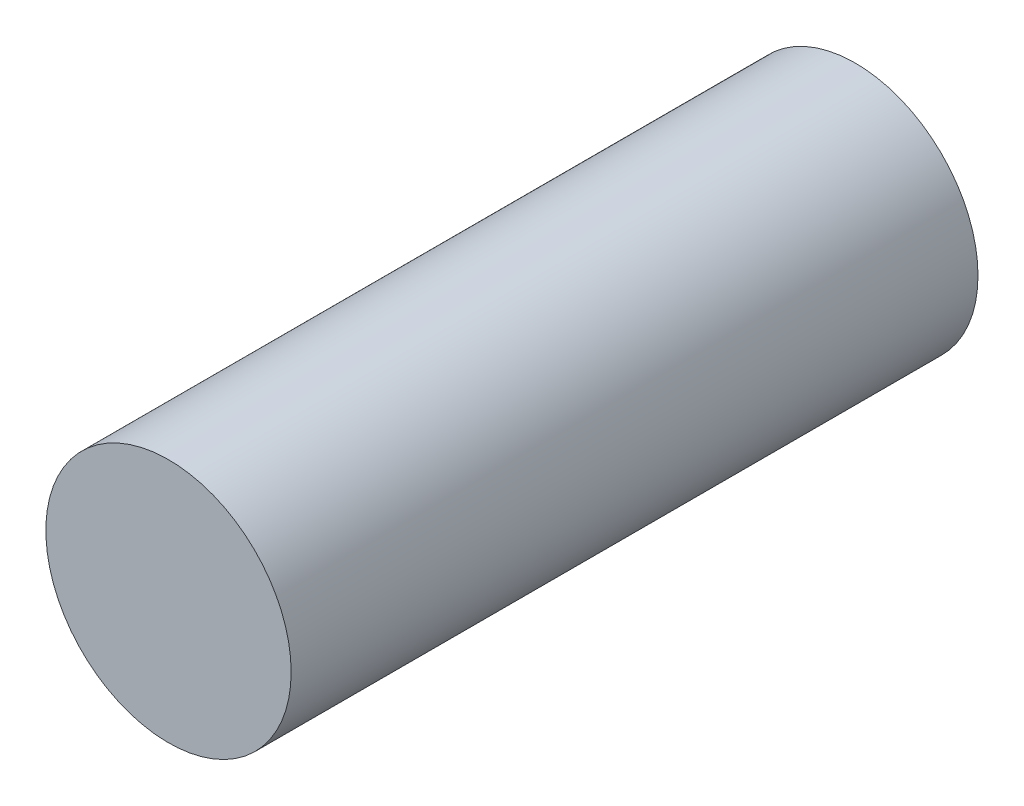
ISO-10303-21;
HEADER;
FILE_DESCRIPTION(('STEP AP214'),'2;1');
FILE_NAME('part.step','',(''),(''),'','','');
FILE_SCHEMA(('AUTOMOTIVE_DESIGN { 1 0 10303 214 1 1 1 1 }'));
ENDSEC;
DATA;
#1=APPLICATION_CONTEXT('core data for automotive mechanical design processes');
#2=APPLICATION_PROTOCOL_DEFINITION('international standard','automotive_design',2000,#1);
#3=PRODUCT_CONTEXT('',#1,'mechanical');
#4=PRODUCT('Part','Part','',(#3));
#5=PRODUCT_RELATED_PRODUCT_CATEGORY('part','',(#4));
#6=PRODUCT_DEFINITION_FORMATION('','',#4);
#7=PRODUCT_DEFINITION_CONTEXT('part definition',#1,'design');
#8=PRODUCT_DEFINITION('design','',#6,#7);
#9=PRODUCT_DEFINITION_SHAPE('','',#8);
#10=(LENGTH_UNIT() NAMED_UNIT(*) SI_UNIT(.MILLI.,.METRE.));
#11=(NAMED_UNIT(*) PLANE_ANGLE_UNIT() SI_UNIT($,.RADIAN.));
#12=(NAMED_UNIT(*) SI_UNIT($,.STERADIAN.) SOLID_ANGLE_UNIT());
#13=UNCERTAINTY_MEASURE_WITH_UNIT(LENGTH_MEASURE(1.E-05),#10,'distance_accuracy_value','');
#14=(GEOMETRIC_REPRESENTATION_CONTEXT(3) GLOBAL_UNCERTAINTY_ASSIGNED_CONTEXT((#13)) GLOBAL_UNIT_ASSIGNED_CONTEXT((#10,
#11,#12)) REPRESENTATION_CONTEXT('',''));
#15=CARTESIAN_POINT('',(0.,0.,0.));
#16=DIRECTION('',(0.,0.,1.));
#17=DIRECTION('',(1.,0.,0.));
#18=AXIS2_PLACEMENT_3D('',#15,#16,#17);
#19=CARTESIAN_POINT('',(-26.1172302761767,26.9098547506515,-12.5355339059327));
#20=DIRECTION('',(0.,0.,1.));
#21=DIRECTION('',(1.,0.,0.));
#22=AXIS2_PLACEMENT_3D('',#19,#20,#21);
#23=CYLINDRICAL_SURFACE('',#22,1.25);
#24=CARTESIAN_POINT('',(-26.1172302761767,26.9098547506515,-6.99999999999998));
#25=DIRECTION('',(0.,0.,1.));
#26=DIRECTION('',(1.,0.,0.));
#27=AXIS2_PLACEMENT_3D('',#24,#25,#26);
#28=CIRCLE('',#27,1.25);
#29=CARTESIAN_POINT('',(-24.8672302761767,26.9098547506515,-6.99999999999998));
#30=VERTEX_POINT('',#29);
#31=EDGE_CURVE('E11',#30,#30,#28,.F.);
#32=ORIENTED_EDGE('',*,*,#31,.F.);
#33=EDGE_LOOP('',(#32));
#34=FACE_BOUND('',#33,.T.);
#35=CARTESIAN_POINT('',(-26.1172302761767,26.9098547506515,0.));
#36=DIRECTION('',(0.,0.,1.));
#37=DIRECTION('',(1.,0.,0.));
#38=AXIS2_PLACEMENT_3D('',#35,#36,#37);
#39=CIRCLE('',#38,1.25);
#40=CARTESIAN_POINT('',(-24.8672302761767,26.9098547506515,0.));
#41=VERTEX_POINT('',#40);
#42=EDGE_CURVE('E381',#41,#41,#39,.T.);
#43=ORIENTED_EDGE('',*,*,#42,.F.);
#44=EDGE_LOOP('',(#43));
#45=FACE_BOUND('',#44,.T.);
#46=ADVANCED_FACE('F375',(#34,#45),#23,.T.);
#47=CARTESIAN_POINT('',(-26.1172302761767,26.9098547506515,0.));
#48=DIRECTION('',(0.,0.,1.));
#49=DIRECTION('',(1.,0.,0.));
#50=AXIS2_PLACEMENT_3D('',#47,#48,#49);
#51=PLANE('',#50);
#52=ORIENTED_EDGE('',*,*,#42,.T.);
#53=EDGE_LOOP('',(#52));
#54=FACE_BOUND('',#53,.T.);
#55=ADVANCED_FACE('F387',(#54),#51,.T.);
#56=CARTESIAN_POINT('',(0.,40.,-6.99999999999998));
#57=DIRECTION('',(0.,0.,1.));
#58=DIRECTION('',(1.,0.,0.));
#59=AXIS2_PLACEMENT_3D('',#56,#57,#58);
#60=PLANE('',#59);
#61=ORIENTED_EDGE('',*,*,#31,.T.);
#62=EDGE_LOOP('',(#61));
#63=FACE_BOUND('',#62,.T.);
#64=ADVANCED_FACE('F394',(#63),#60,.F.);
#65=CLOSED_SHELL('',(#46,#55,#64));
#66=MANIFOLD_SOLID_BREP('B2',#65);
#67=ADVANCED_BREP_SHAPE_REPRESENTATION('',(#18,#66),#14);
#68=SHAPE_DEFINITION_REPRESENTATION(#9,#67);
ENDSEC;
END-ISO-10303-21;
